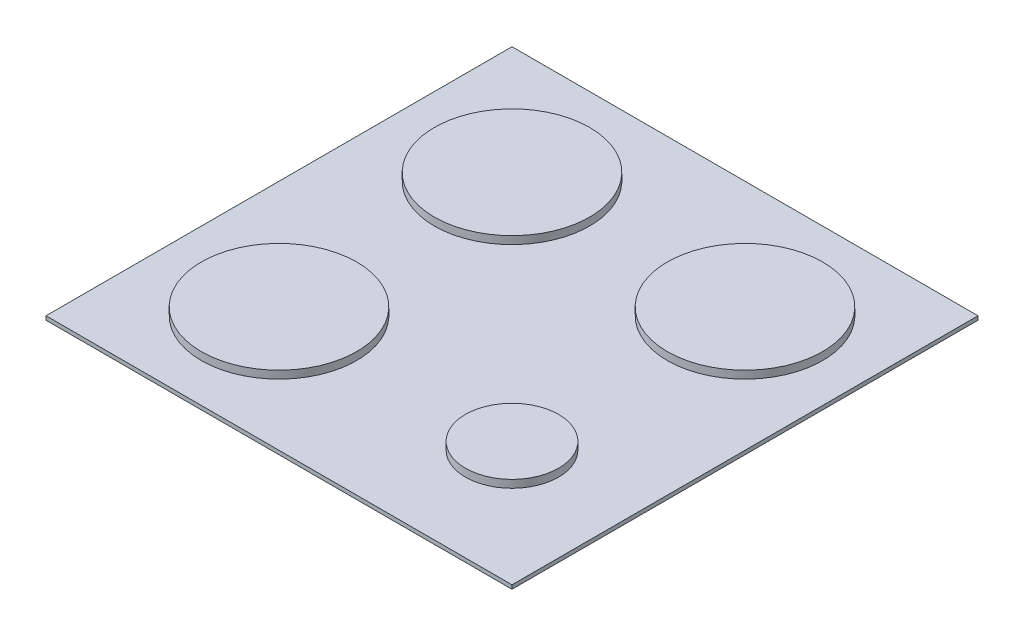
from build123d import *

# Parameters (mm, degrees)
ESQUISSE1_W        = 600
ESQUISSE1_H        = 5
BOSS_EXTRU_1_DEPTH = 600
ESQUISSE7_R        = 100
ESQUISSE7_R_2      = 60
BOSS_EXTRU_5_DEPTH = 10


with BuildPart() as part:
    # Esquisse1 → Boss.-Extru.1 (new body)
    with BuildSketch(Plane.XY):
        with Locations((300, 2.5)):
            Rectangle(ESQUISSE1_W, ESQUISSE1_H)
    extrude(amount=BOSS_EXTRU_1_DEPTH)

    # Esquisse7 → Boss.-Extru.5 (add)
    with BuildSketch(Plane(origin=(0, 5, 0), x_dir=(1, 0, 0), z_dir=(0, 1, 0))):
        with Locations(Location((150, -150, 0), (0, 0, 90))):
            Circle(ESQUISSE7_R)
        with Locations(Location((450, -150, 0), (0, 0, 90))):
            Circle(ESQUISSE7_R)
        with Locations(Location((150, -450, 0), (0, 0, 90))):
            Circle(ESQUISSE7_R)
        with Locations(Location((450, -450, 0), (0, 0, 90))):
            Circle(ESQUISSE7_R_2)
    extrude(amount=BOSS_EXTRU_5_DEPTH)


solid = part.part
